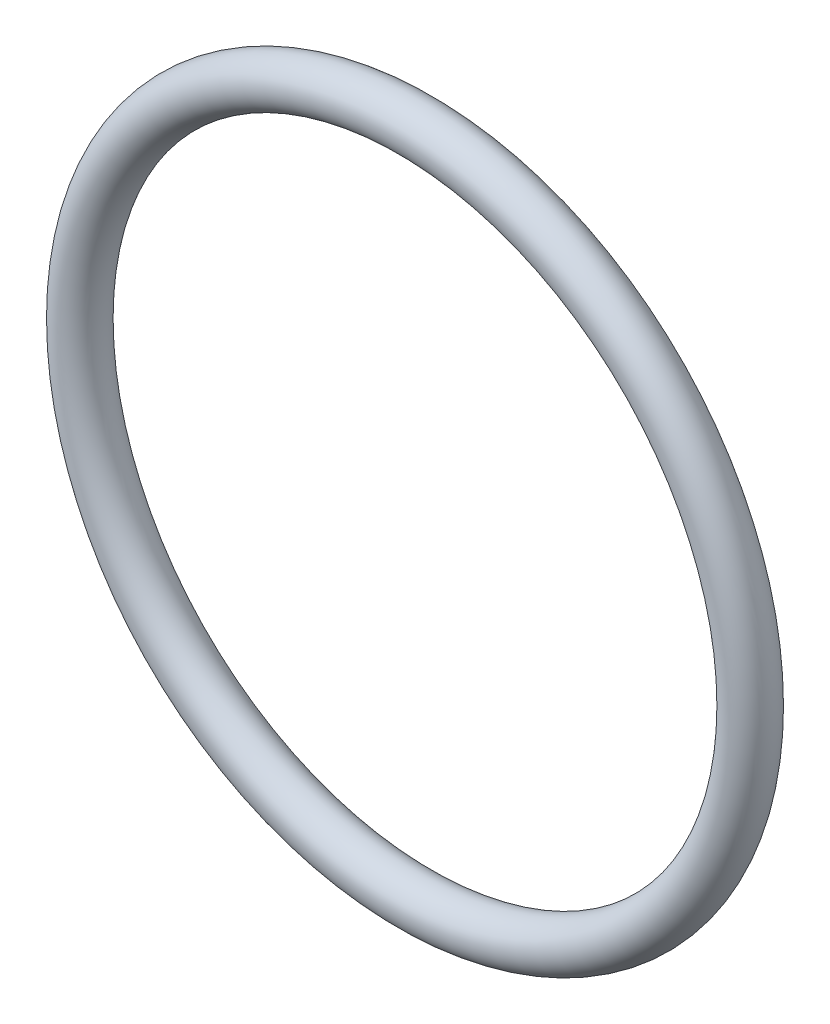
ISO-10303-21;
HEADER;
FILE_DESCRIPTION(('STEP AP214'),'2;1');
FILE_NAME('part.step','',(''),(''),'','','');
FILE_SCHEMA(('AUTOMOTIVE_DESIGN { 1 0 10303 214 1 1 1 1 }'));
ENDSEC;
DATA;
#1=APPLICATION_CONTEXT('core data for automotive mechanical design processes');
#2=APPLICATION_PROTOCOL_DEFINITION('international standard','automotive_design',2000,#1);
#3=PRODUCT_CONTEXT('',#1,'mechanical');
#4=PRODUCT('Part','Part','',(#3));
#5=PRODUCT_RELATED_PRODUCT_CATEGORY('part','',(#4));
#6=PRODUCT_DEFINITION_FORMATION('','',#4);
#7=PRODUCT_DEFINITION_CONTEXT('part definition',#1,'design');
#8=PRODUCT_DEFINITION('design','',#6,#7);
#9=PRODUCT_DEFINITION_SHAPE('','',#8);
#10=(LENGTH_UNIT() NAMED_UNIT(*) SI_UNIT(.MILLI.,.METRE.));
#11=(NAMED_UNIT(*) PLANE_ANGLE_UNIT() SI_UNIT($,.RADIAN.));
#12=(NAMED_UNIT(*) SI_UNIT($,.STERADIAN.) SOLID_ANGLE_UNIT());
#13=UNCERTAINTY_MEASURE_WITH_UNIT(LENGTH_MEASURE(1.E-05),#10,'distance_accuracy_value','');
#14=(GEOMETRIC_REPRESENTATION_CONTEXT(3) GLOBAL_UNCERTAINTY_ASSIGNED_CONTEXT((#13)) GLOBAL_UNIT_ASSIGNED_CONTEXT((#10,
#11,#12)) REPRESENTATION_CONTEXT('',''));
#15=CARTESIAN_POINT('',(0.,0.,0.));
#16=DIRECTION('',(0.,0.,1.));
#17=DIRECTION('',(1.,0.,0.));
#18=AXIS2_PLACEMENT_3D('',#15,#16,#17);
#19=CARTESIAN_POINT('',(0.,0.,0.));
#20=DIRECTION('',(0.,0.,1.));
#21=DIRECTION('',(1.,0.,0.));
#22=AXIS2_PLACEMENT_3D('',#19,#20,#21);
#23=TOROIDAL_SURFACE('',#22,12.6492,0.889);
#24=CARTESIAN_POINT('',(13.5382,0.,0.));
#25=VERTEX_POINT('',#24);
#26=VERTEX_LOOP('',#25);
#27=FACE_BOUND('',#26,.T.);
#28=ADVANCED_FACE('F33',(#27),#23,.T.);
#29=CLOSED_SHELL('',(#28));
#30=MANIFOLD_SOLID_BREP('B2',#29);
#31=ADVANCED_BREP_SHAPE_REPRESENTATION('',(#18,#30),#14);
#32=SHAPE_DEFINITION_REPRESENTATION(#9,#31);
ENDSEC;
END-ISO-10303-21;
